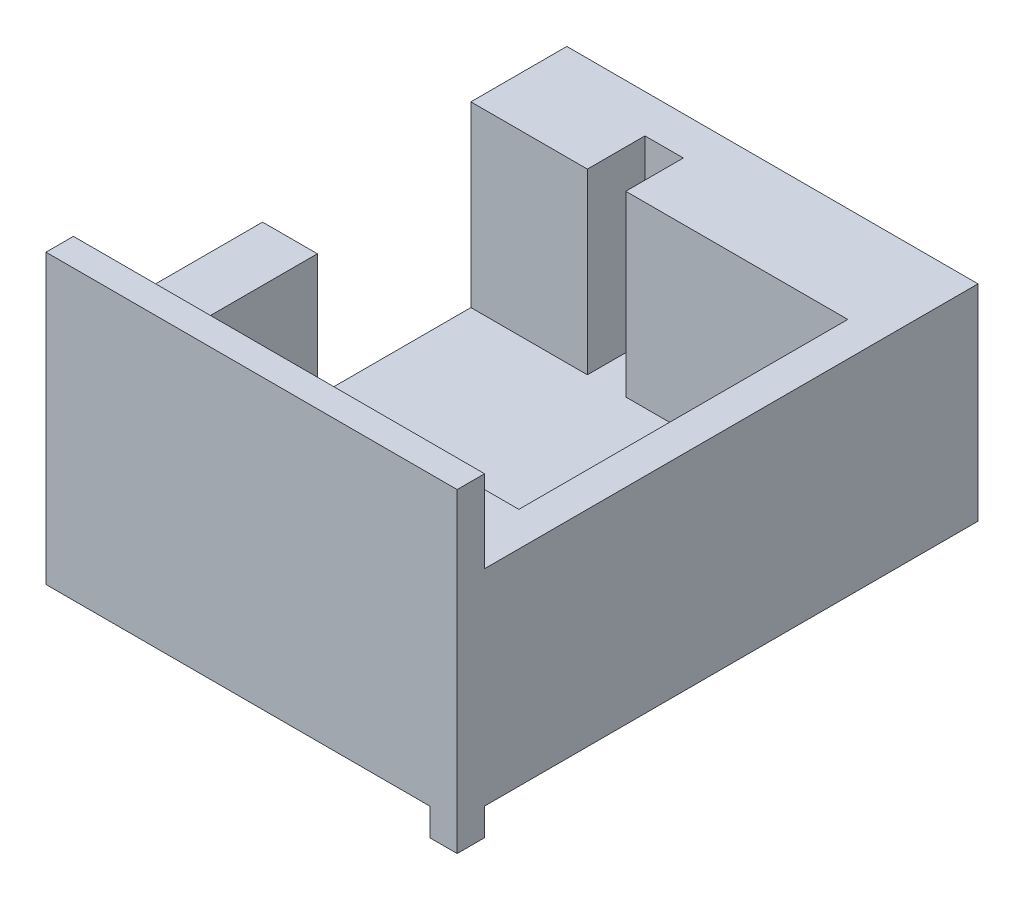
ISO-10303-21;
HEADER;
FILE_DESCRIPTION(('STEP AP214'),'2;1');
FILE_NAME('part.step','',(''),(''),'','','');
FILE_SCHEMA(('AUTOMOTIVE_DESIGN { 1 0 10303 214 1 1 1 1 }'));
ENDSEC;
DATA;
#1=APPLICATION_CONTEXT('core data for automotive mechanical design processes');
#2=APPLICATION_PROTOCOL_DEFINITION('international standard','automotive_design',2000,#1);
#3=PRODUCT_CONTEXT('',#1,'mechanical');
#4=PRODUCT('Part','Part','',(#3));
#5=PRODUCT_RELATED_PRODUCT_CATEGORY('part','',(#4));
#6=PRODUCT_DEFINITION_FORMATION('','',#4);
#7=PRODUCT_DEFINITION_CONTEXT('part definition',#1,'design');
#8=PRODUCT_DEFINITION('design','',#6,#7);
#9=PRODUCT_DEFINITION_SHAPE('','',#8);
#10=(LENGTH_UNIT() NAMED_UNIT(*) SI_UNIT(.MILLI.,.METRE.));
#11=(NAMED_UNIT(*) PLANE_ANGLE_UNIT() SI_UNIT($,.RADIAN.));
#12=(NAMED_UNIT(*) SI_UNIT($,.STERADIAN.) SOLID_ANGLE_UNIT());
#13=UNCERTAINTY_MEASURE_WITH_UNIT(LENGTH_MEASURE(1.E-05),#10,'distance_accuracy_value','');
#14=(GEOMETRIC_REPRESENTATION_CONTEXT(3) GLOBAL_UNCERTAINTY_ASSIGNED_CONTEXT((#13)) GLOBAL_UNIT_ASSIGNED_CONTEXT((#10,
#11,#12)) REPRESENTATION_CONTEXT('',''));
#15=CARTESIAN_POINT('',(0.,0.,0.));
#16=DIRECTION('',(0.,0.,1.));
#17=DIRECTION('',(1.,0.,0.));
#18=AXIS2_PLACEMENT_3D('',#15,#16,#17);
#19=CARTESIAN_POINT('',(-15.,15.,19.));
#20=DIRECTION('',(1.,0.,0.));
#21=DIRECTION('',(0.,0.,-1.));
#22=AXIS2_PLACEMENT_3D('',#19,#20,#21);
#23=PLANE('',#22);
#24=DIRECTION('',(0.,0.,1.));
#25=VECTOR('',#24,1.);
#26=CARTESIAN_POINT('',(-15.,15.,19.));
#27=LINE('',#26,#25);
#28=CARTESIAN_POINT('',(-15.,15.,3.2));
#29=VERTEX_POINT('',#28);
#30=CARTESIAN_POINT('',(-15.,15.,17.));
#31=VERTEX_POINT('',#30);
#32=EDGE_CURVE('E242',#29,#31,#27,.T.);
#33=ORIENTED_EDGE('',*,*,#32,.F.);
#34=DIRECTION('',(0.,1.,0.));
#35=VECTOR('',#34,1.);
#36=CARTESIAN_POINT('',(-15.,15.,3.2));
#37=LINE('',#36,#35);
#38=CARTESIAN_POINT('',(-15.,2.,3.2));
#39=VERTEX_POINT('',#38);
#40=EDGE_CURVE('E225',#39,#29,#37,.T.);
#41=ORIENTED_EDGE('',*,*,#40,.F.);
#42=DIRECTION('',(0.,0.,1.));
#43=VECTOR('',#42,1.);
#44=CARTESIAN_POINT('',(-15.,2.,-12.));
#45=LINE('',#44,#43);
#46=CARTESIAN_POINT('',(-15.,2.,-12.));
#47=VERTEX_POINT('',#46);
#48=EDGE_CURVE('E236',#47,#39,#45,.T.);
#49=ORIENTED_EDGE('',*,*,#48,.F.);
#50=DIRECTION('',(0.,1.,0.));
#51=VECTOR('',#50,1.);
#52=CARTESIAN_POINT('',(-15.,0.,-12.));
#53=LINE('',#52,#51);
#54=CARTESIAN_POINT('',(-15.,15.,-12.));
#55=VERTEX_POINT('',#54);
#56=EDGE_CURVE('E319',#47,#55,#53,.T.);
#57=ORIENTED_EDGE('',*,*,#56,.T.);
#58=CARTESIAN_POINT('',(-15.,15.,-19.));
#59=VERTEX_POINT('',#58);
#60=EDGE_CURVE('E251',#59,#55,#27,.T.);
#61=ORIENTED_EDGE('',*,*,#60,.F.);
#62=DIRECTION('',(0.,-1.,0.));
#63=VECTOR('',#62,1.);
#64=CARTESIAN_POINT('',(-15.,15.,-19.));
#65=LINE('',#64,#63);
#66=CARTESIAN_POINT('',(-15.,0.,-19.));
#67=VERTEX_POINT('',#66);
#68=EDGE_CURVE('E289',#59,#67,#65,.T.);
#69=ORIENTED_EDGE('',*,*,#68,.T.);
#70=DIRECTION('',(0.,0.,1.));
#71=VECTOR('',#70,1.);
#72=CARTESIAN_POINT('',(-15.,0.,19.));
#73=LINE('',#72,#71);
#74=CARTESIAN_POINT('',(-15.,0.,19.));
#75=VERTEX_POINT('',#74);
#76=EDGE_CURVE('E281',#67,#75,#73,.T.);
#77=ORIENTED_EDGE('',*,*,#76,.T.);
#78=DIRECTION('',(0.,-1.,0.));
#79=VECTOR('',#78,1.);
#80=CARTESIAN_POINT('',(-15.,15.,19.));
#81=LINE('',#80,#79);
#82=CARTESIAN_POINT('',(-15.,21.,19.));
#83=VERTEX_POINT('',#82);
#84=EDGE_CURVE('E287',#83,#75,#81,.T.);
#85=ORIENTED_EDGE('',*,*,#84,.F.);
#86=DIRECTION('',(0.,0.,-1.));
#87=VECTOR('',#86,1.);
#88=CARTESIAN_POINT('',(-15.,21.,19.));
#89=LINE('',#88,#87);
#90=CARTESIAN_POINT('',(-15.,21.,17.));
#91=VERTEX_POINT('',#90);
#92=EDGE_CURVE('E470',#83,#91,#89,.T.);
#93=ORIENTED_EDGE('',*,*,#92,.T.);
#94=DIRECTION('',(0.,-1.,0.));
#95=VECTOR('',#94,1.);
#96=CARTESIAN_POINT('',(-15.,15.,17.));
#97=LINE('',#96,#95);
#98=EDGE_CURVE('E249',#91,#31,#97,.T.);
#99=ORIENTED_EDGE('',*,*,#98,.T.);
#100=EDGE_LOOP('',(#33,#41,#49,#57,#61,#69,#77,#85,#93,#99));
#101=FACE_BOUND('',#100,.T.);
#102=ADVANCED_FACE('F57',(#101),#23,.F.);
#103=CARTESIAN_POINT('',(0.,15.,0.));
#104=DIRECTION('',(0.,-1.,0.));
#105=DIRECTION('',(0.,0.,-1.));
#106=AXIS2_PLACEMENT_3D('',#103,#104,#105);
#107=PLANE('',#106);
#108=DIRECTION('',(0.,0.,1.));
#109=VECTOR('',#108,1.);
#110=CARTESIAN_POINT('',(-11.,15.,12.));
#111=LINE('',#110,#109);
#112=CARTESIAN_POINT('',(-11.,15.,3.2));
#113=VERTEX_POINT('',#112);
#114=CARTESIAN_POINT('',(-11.,15.,12.));
#115=VERTEX_POINT('',#114);
#116=EDGE_CURVE('E245',#113,#115,#111,.T.);
#117=ORIENTED_EDGE('',*,*,#116,.F.);
#118=DIRECTION('',(-1.,0.,0.));
#119=VECTOR('',#118,1.);
#120=CARTESIAN_POINT('',(15.00105,15.,3.2));
#121=LINE('',#120,#119);
#122=EDGE_CURVE('E228',#113,#29,#121,.T.);
#123=ORIENTED_EDGE('',*,*,#122,.T.);
#124=ORIENTED_EDGE('',*,*,#32,.T.);
#125=DIRECTION('',(1.,0.,0.));
#126=VECTOR('',#125,1.);
#127=CARTESIAN_POINT('',(-21.3245553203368,15.,17.));
#128=LINE('',#127,#126);
#129=CARTESIAN_POINT('',(15.,15.,17.));
#130=VERTEX_POINT('',#129);
#131=EDGE_CURVE('E412',#31,#130,#128,.T.);
#132=ORIENTED_EDGE('',*,*,#131,.T.);
#133=DIRECTION('',(0.,0.,-1.));
#134=VECTOR('',#133,1.);
#135=CARTESIAN_POINT('',(15.,15.,19.));
#136=LINE('',#135,#134);
#137=CARTESIAN_POINT('',(15.,15.,-19.));
#138=VERTEX_POINT('',#137);
#139=EDGE_CURVE('E257',#130,#138,#136,.T.);
#140=ORIENTED_EDGE('',*,*,#139,.T.);
#141=DIRECTION('',(-1.,0.,0.));
#142=VECTOR('',#141,1.);
#143=CARTESIAN_POINT('',(-15.,15.,-19.));
#144=LINE('',#143,#142);
#145=EDGE_CURVE('E252',#138,#59,#144,.T.);
#146=ORIENTED_EDGE('',*,*,#145,.T.);
#147=ORIENTED_EDGE('',*,*,#60,.T.);
#148=DIRECTION('',(-1.,0.,0.));
#149=VECTOR('',#148,1.);
#150=CARTESIAN_POINT('',(-6.5,15.,-12.));
#151=LINE('',#150,#149);
#152=CARTESIAN_POINT('',(-6.5,15.,-12.));
#153=VERTEX_POINT('',#152);
#154=EDGE_CURVE('E364',#153,#55,#151,.T.);
#155=ORIENTED_EDGE('',*,*,#154,.F.);
#156=DIRECTION('',(0.,0.,1.));
#157=VECTOR('',#156,1.);
#158=CARTESIAN_POINT('',(-6.5,15.,-16.2));
#159=LINE('',#158,#157);
#160=CARTESIAN_POINT('',(-6.5,15.,-16.2));
#161=VERTEX_POINT('',#160);
#162=EDGE_CURVE('E361',#161,#153,#159,.T.);
#163=ORIENTED_EDGE('',*,*,#162,.F.);
#164=DIRECTION('',(-1.,0.,0.));
#165=VECTOR('',#164,1.);
#166=CARTESIAN_POINT('',(-3.7,15.,-16.2));
#167=LINE('',#166,#165);
#168=CARTESIAN_POINT('',(-3.7,15.,-16.2));
#169=VERTEX_POINT('',#168);
#170=EDGE_CURVE('E358',#169,#161,#167,.T.);
#171=ORIENTED_EDGE('',*,*,#170,.F.);
#172=DIRECTION('',(0.,0.,-1.));
#173=VECTOR('',#172,1.);
#174=CARTESIAN_POINT('',(-3.7,15.,-12.));
#175=LINE('',#174,#173);
#176=CARTESIAN_POINT('',(-3.7,15.,-12.));
#177=VERTEX_POINT('',#176);
#178=EDGE_CURVE('E355',#177,#169,#175,.T.);
#179=ORIENTED_EDGE('',*,*,#178,.F.);
#180=DIRECTION('',(-1.,0.,0.));
#181=VECTOR('',#180,1.);
#182=CARTESIAN_POINT('',(12.5,15.,-12.));
#183=LINE('',#182,#181);
#184=CARTESIAN_POINT('',(12.5,15.,-12.));
#185=VERTEX_POINT('',#184);
#186=EDGE_CURVE('E352',#185,#177,#183,.T.);
#187=ORIENTED_EDGE('',*,*,#186,.F.);
#188=DIRECTION('',(0.,0.,-1.));
#189=VECTOR('',#188,1.);
#190=CARTESIAN_POINT('',(12.5,15.,-12.));
#191=LINE('',#190,#189);
#192=CARTESIAN_POINT('',(12.5,15.,12.));
#193=VERTEX_POINT('',#192);
#194=EDGE_CURVE('E349',#193,#185,#191,.T.);
#195=ORIENTED_EDGE('',*,*,#194,.F.);
#196=DIRECTION('',(1.,0.,0.));
#197=VECTOR('',#196,1.);
#198=CARTESIAN_POINT('',(12.5,15.,12.));
#199=LINE('',#198,#197);
#200=CARTESIAN_POINT('',(-3.7,15.,12.));
#201=VERTEX_POINT('',#200);
#202=EDGE_CURVE('E347',#201,#193,#199,.T.);
#203=ORIENTED_EDGE('',*,*,#202,.F.);
#204=DIRECTION('',(0.,0.,-1.));
#205=VECTOR('',#204,1.);
#206=CARTESIAN_POINT('',(-3.7,15.,12.));
#207=LINE('',#206,#205);
#208=CARTESIAN_POINT('',(-3.7,15.,16.2));
#209=VERTEX_POINT('',#208);
#210=EDGE_CURVE('E314',#209,#201,#207,.T.);
#211=ORIENTED_EDGE('',*,*,#210,.F.);
#212=DIRECTION('',(1.,0.,0.));
#213=VECTOR('',#212,1.);
#214=CARTESIAN_POINT('',(-3.7,15.,16.2));
#215=LINE('',#214,#213);
#216=CARTESIAN_POINT('',(-6.5,15.,16.2));
#217=VERTEX_POINT('',#216);
#218=EDGE_CURVE('E373',#217,#209,#215,.T.);
#219=ORIENTED_EDGE('',*,*,#218,.F.);
#220=DIRECTION('',(0.,0.,1.));
#221=VECTOR('',#220,1.);
#222=CARTESIAN_POINT('',(-6.5,15.,16.2));
#223=LINE('',#222,#221);
#224=CARTESIAN_POINT('',(-6.5,15.,12.));
#225=VERTEX_POINT('',#224);
#226=EDGE_CURVE('E370',#225,#217,#223,.T.);
#227=ORIENTED_EDGE('',*,*,#226,.F.);
#228=DIRECTION('',(1.,0.,0.));
#229=VECTOR('',#228,1.);
#230=CARTESIAN_POINT('',(-6.5,15.,12.));
#231=LINE('',#230,#229);
#232=EDGE_CURVE('E367',#115,#225,#231,.T.);
#233=ORIENTED_EDGE('',*,*,#232,.F.);
#234=EDGE_LOOP('',(#117,#123,#124,#132,#140,#146,#147,#155,#163,#171,#179,#187,#195,#203,#211,
#219,#227,#233));
#235=FACE_BOUND('',#234,.T.);
#236=ADVANCED_FACE('F240',(#235),#107,.F.);
#237=CARTESIAN_POINT('',(-11.,2.,12.));
#238=DIRECTION('',(-1.,0.,0.));
#239=DIRECTION('',(0.,0.,1.));
#240=AXIS2_PLACEMENT_3D('',#237,#238,#239);
#241=PLANE('',#240);
#242=DIRECTION('',(0.,0.,1.));
#243=VECTOR('',#242,1.);
#244=CARTESIAN_POINT('',(-11.,2.,12.));
#245=LINE('',#244,#243);
#246=CARTESIAN_POINT('',(-11.,2.,3.2));
#247=VERTEX_POINT('',#246);
#248=CARTESIAN_POINT('',(-11.,2.,12.));
#249=VERTEX_POINT('',#248);
#250=EDGE_CURVE('E332',#247,#249,#245,.T.);
#251=ORIENTED_EDGE('',*,*,#250,.F.);
#252=DIRECTION('',(0.,-1.,0.));
#253=VECTOR('',#252,1.);
#254=CARTESIAN_POINT('',(-11.,15.,3.2));
#255=LINE('',#254,#253);
#256=EDGE_CURVE('E246',#113,#247,#255,.T.);
#257=ORIENTED_EDGE('',*,*,#256,.F.);
#258=ORIENTED_EDGE('',*,*,#116,.T.);
#259=DIRECTION('',(0.,1.,0.));
#260=VECTOR('',#259,1.);
#261=CARTESIAN_POINT('',(-11.,2.,12.));
#262=LINE('',#261,#260);
#263=EDGE_CURVE('E385',#249,#115,#262,.T.);
#264=ORIENTED_EDGE('',*,*,#263,.F.);
#265=EDGE_LOOP('',(#251,#257,#258,#264));
#266=FACE_BOUND('',#265,.T.);
#267=ADVANCED_FACE('F501',(#266),#241,.F.);
#268=CARTESIAN_POINT('',(15.,15.,19.));
#269=DIRECTION('',(-1.,0.,0.));
#270=DIRECTION('',(0.,0.,1.));
#271=AXIS2_PLACEMENT_3D('',#268,#269,#270);
#272=PLANE('',#271);
#273=DIRECTION('',(0.,-1.,0.));
#274=VECTOR('',#273,1.);
#275=CARTESIAN_POINT('',(15.,15.,19.));
#276=LINE('',#275,#274);
#277=CARTESIAN_POINT('',(15.,21.,19.));
#278=VERTEX_POINT('',#277);
#279=CARTESIAN_POINT('',(15.,-2.,19.));
#280=VERTEX_POINT('',#279);
#281=EDGE_CURVE('E255',#278,#280,#276,.T.);
#282=ORIENTED_EDGE('',*,*,#281,.T.);
#283=DIRECTION('',(0.,0.,1.));
#284=VECTOR('',#283,1.);
#285=CARTESIAN_POINT('',(15.,-2.,19.));
#286=LINE('',#285,#284);
#287=CARTESIAN_POINT('',(15.,-2.,17.));
#288=VERTEX_POINT('',#287);
#289=EDGE_CURVE('E419',#288,#280,#286,.T.);
#290=ORIENTED_EDGE('',*,*,#289,.F.);
#291=DIRECTION('',(0.,1.,0.));
#292=VECTOR('',#291,1.);
#293=CARTESIAN_POINT('',(15.,-2.,17.));
#294=LINE('',#293,#292);
#295=CARTESIAN_POINT('',(15.,0.,17.));
#296=VERTEX_POINT('',#295);
#297=EDGE_CURVE('E429',#288,#296,#294,.T.);
#298=ORIENTED_EDGE('',*,*,#297,.T.);
#299=DIRECTION('',(0.,0.,-1.));
#300=VECTOR('',#299,1.);
#301=CARTESIAN_POINT('',(15.,0.,19.));
#302=LINE('',#301,#300);
#303=CARTESIAN_POINT('',(15.,0.,-19.));
#304=VERTEX_POINT('',#303);
#305=EDGE_CURVE('E271',#296,#304,#302,.T.);
#306=ORIENTED_EDGE('',*,*,#305,.T.);
#307=DIRECTION('',(0.,-1.,0.));
#308=VECTOR('',#307,1.);
#309=CARTESIAN_POINT('',(15.,15.,-19.));
#310=LINE('',#309,#308);
#311=EDGE_CURVE('E275',#138,#304,#310,.T.);
#312=ORIENTED_EDGE('',*,*,#311,.F.);
#313=ORIENTED_EDGE('',*,*,#139,.F.);
#314=DIRECTION('',(0.,1.,0.));
#315=VECTOR('',#314,1.);
#316=CARTESIAN_POINT('',(15.,15.,17.));
#317=LINE('',#316,#315);
#318=CARTESIAN_POINT('',(15.,21.,17.));
#319=VERTEX_POINT('',#318);
#320=EDGE_CURVE('E405',#130,#319,#317,.T.);
#321=ORIENTED_EDGE('',*,*,#320,.T.);
#322=DIRECTION('',(0.,0.,1.));
#323=VECTOR('',#322,1.);
#324=CARTESIAN_POINT('',(15.,21.,19.));
#325=LINE('',#324,#323);
#326=EDGE_CURVE('E408',#319,#278,#325,.T.);
#327=ORIENTED_EDGE('',*,*,#326,.T.);
#328=EDGE_LOOP('',(#282,#290,#298,#306,#312,#313,#321,#327));
#329=FACE_BOUND('',#328,.T.);
#330=ADVANCED_FACE('F59',(#329),#272,.F.);
#331=CARTESIAN_POINT('',(-15.,15.,-19.));
#332=DIRECTION('',(0.,0.,1.));
#333=DIRECTION('',(1.,0.,0.));
#334=AXIS2_PLACEMENT_3D('',#331,#332,#333);
#335=PLANE('',#334);
#336=DIRECTION('',(-1.,0.,0.));
#337=VECTOR('',#336,1.);
#338=CARTESIAN_POINT('',(-15.,0.,-19.));
#339=LINE('',#338,#337);
#340=EDGE_CURVE('E268',#304,#67,#339,.T.);
#341=ORIENTED_EDGE('',*,*,#340,.T.);
#342=ORIENTED_EDGE('',*,*,#68,.F.);
#343=ORIENTED_EDGE('',*,*,#145,.F.);
#344=ORIENTED_EDGE('',*,*,#311,.T.);
#345=EDGE_LOOP('',(#341,#342,#343,#344));
#346=FACE_BOUND('',#345,.T.);
#347=ADVANCED_FACE('F459',(#346),#335,.F.);
#348=CARTESIAN_POINT('',(-15.,15.,19.));
#349=DIRECTION('',(0.,0.,-1.));
#350=DIRECTION('',(-1.,0.,0.));
#351=AXIS2_PLACEMENT_3D('',#348,#349,#350);
#352=PLANE('',#351);
#353=DIRECTION('',(1.,0.,0.));
#354=VECTOR('',#353,1.);
#355=CARTESIAN_POINT('',(-15.,0.,19.));
#356=LINE('',#355,#354);
#357=CARTESIAN_POINT('',(13.,0.,19.));
#358=VERTEX_POINT('',#357);
#359=EDGE_CURVE('E277',#75,#358,#356,.T.);
#360=ORIENTED_EDGE('',*,*,#359,.T.);
#361=DIRECTION('',(0.,1.,0.));
#362=VECTOR('',#361,1.);
#363=CARTESIAN_POINT('',(13.,-2.,19.));
#364=LINE('',#363,#362);
#365=CARTESIAN_POINT('',(13.,-2.,19.));
#366=VERTEX_POINT('',#365);
#367=EDGE_CURVE('E442',#366,#358,#364,.T.);
#368=ORIENTED_EDGE('',*,*,#367,.F.);
#369=DIRECTION('',(-1.,0.,0.));
#370=VECTOR('',#369,1.);
#371=CARTESIAN_POINT('',(15.,-2.,19.));
#372=LINE('',#371,#370);
#373=EDGE_CURVE('E422',#280,#366,#372,.T.);
#374=ORIENTED_EDGE('',*,*,#373,.F.);
#375=ORIENTED_EDGE('',*,*,#281,.F.);
#376=DIRECTION('',(1.,0.,0.));
#377=VECTOR('',#376,1.);
#378=CARTESIAN_POINT('',(-21.3245553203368,21.,19.));
#379=LINE('',#378,#377);
#380=EDGE_CURVE('E468',#83,#278,#379,.T.);
#381=ORIENTED_EDGE('',*,*,#380,.F.);
#382=ORIENTED_EDGE('',*,*,#84,.T.);
#383=EDGE_LOOP('',(#360,#368,#374,#375,#381,#382));
#384=FACE_BOUND('',#383,.T.);
#385=ADVANCED_FACE('F466',(#384),#352,.F.);
#386=CARTESIAN_POINT('',(0.,0.,0.));
#387=DIRECTION('',(0.,-1.,0.));
#388=DIRECTION('',(0.,0.,-1.));
#389=AXIS2_PLACEMENT_3D('',#386,#387,#388);
#390=PLANE('',#389);
#391=DIRECTION('',(0.,0.,1.));
#392=VECTOR('',#391,1.);
#393=CARTESIAN_POINT('',(12.5,0.,0.));
#394=LINE('',#393,#392);
#395=CARTESIAN_POINT('',(12.5,0.,-12.));
#396=VERTEX_POINT('',#395);
#397=CARTESIAN_POINT('',(12.5,0.,12.));
#398=VERTEX_POINT('',#397);
#399=EDGE_CURVE('E12',#396,#398,#394,.T.);
#400=ORIENTED_EDGE('',*,*,#399,.F.);
#401=DIRECTION('',(1.,0.,0.));
#402=VECTOR('',#401,1.);
#403=CARTESIAN_POINT('',(0.,0.,-12.));
#404=LINE('',#403,#402);
#405=CARTESIAN_POINT('',(9.49999999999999,0.,-12.));
#406=VERTEX_POINT('',#405);
#407=EDGE_CURVE('E295',#406,#396,#404,.T.);
#408=ORIENTED_EDGE('',*,*,#407,.F.);
#409=DIRECTION('',(0.,0.,-1.));
#410=VECTOR('',#409,1.);
#411=CARTESIAN_POINT('',(9.5,0.,0.));
#412=LINE('',#411,#410);
#413=CARTESIAN_POINT('',(9.5,0.,12.));
#414=VERTEX_POINT('',#413);
#415=EDGE_CURVE('E299',#414,#406,#412,.T.);
#416=ORIENTED_EDGE('',*,*,#415,.F.);
#417=DIRECTION('',(-1.,0.,0.));
#418=VECTOR('',#417,1.);
#419=CARTESIAN_POINT('',(0.,0.,12.));
#420=LINE('',#419,#418);
#421=EDGE_CURVE('E66',#398,#414,#420,.T.);
#422=ORIENTED_EDGE('',*,*,#421,.F.);
#423=EDGE_LOOP('',(#400,#408,#416,#422));
#424=FACE_BOUND('',#423,.T.);
#425=DIRECTION('',(1.,0.,0.));
#426=VECTOR('',#425,1.);
#427=CARTESIAN_POINT('',(15.,0.,17.));
#428=LINE('',#427,#426);
#429=CARTESIAN_POINT('',(13.,0.,17.));
#430=VERTEX_POINT('',#429);
#431=EDGE_CURVE('E423',#430,#296,#428,.T.);
#432=ORIENTED_EDGE('',*,*,#431,.F.);
#433=DIRECTION('',(0.,0.,-1.));
#434=VECTOR('',#433,1.);
#435=CARTESIAN_POINT('',(13.,0.,19.));
#436=LINE('',#435,#434);
#437=EDGE_CURVE('E282',#358,#430,#436,.T.);
#438=ORIENTED_EDGE('',*,*,#437,.F.);
#439=ORIENTED_EDGE('',*,*,#359,.F.);
#440=ORIENTED_EDGE('',*,*,#76,.F.);
#441=ORIENTED_EDGE('',*,*,#340,.F.);
#442=ORIENTED_EDGE('',*,*,#305,.F.);
#443=EDGE_LOOP('',(#432,#438,#439,#440,#441,#442));
#444=FACE_BOUND('',#443,.T.);
#445=ADVANCED_FACE('F469',(#424,#444),#390,.T.);
#446=CARTESIAN_POINT('',(12.5,2.,12.));
#447=DIRECTION('',(0.,0.,1.));
#448=DIRECTION('',(1.,0.,0.));
#449=AXIS2_PLACEMENT_3D('',#446,#447,#448);
#450=PLANE('',#449);
#451=ORIENTED_EDGE('',*,*,#202,.T.);
#452=DIRECTION('',(0.,1.,0.));
#453=VECTOR('',#452,1.);
#454=CARTESIAN_POINT('',(12.5,2.,12.));
#455=LINE('',#454,#453);
#456=EDGE_CURVE('E346',#398,#193,#455,.T.);
#457=ORIENTED_EDGE('',*,*,#456,.F.);
#458=ORIENTED_EDGE('',*,*,#421,.T.);
#459=DIRECTION('',(0.,1.,0.));
#460=VECTOR('',#459,1.);
#461=CARTESIAN_POINT('',(9.5,-8.,12.));
#462=LINE('',#461,#460);
#463=CARTESIAN_POINT('',(9.5,2.,12.));
#464=VERTEX_POINT('',#463);
#465=EDGE_CURVE('E409',#414,#464,#462,.T.);
#466=ORIENTED_EDGE('',*,*,#465,.T.);
#467=DIRECTION('',(1.,0.,0.));
#468=VECTOR('',#467,1.);
#469=CARTESIAN_POINT('',(12.5,2.,12.));
#470=LINE('',#469,#468);
#471=CARTESIAN_POINT('',(-3.7,2.,12.));
#472=VERTEX_POINT('',#471);
#473=EDGE_CURVE('E309',#472,#464,#470,.T.);
#474=ORIENTED_EDGE('',*,*,#473,.F.);
#475=DIRECTION('',(0.,1.,0.));
#476=VECTOR('',#475,1.);
#477=CARTESIAN_POINT('',(-3.7,2.,12.));
#478=LINE('',#477,#476);
#479=EDGE_CURVE('E274',#472,#201,#478,.T.);
#480=ORIENTED_EDGE('',*,*,#479,.T.);
#481=EDGE_LOOP('',(#451,#457,#458,#466,#474,#480));
#482=FACE_BOUND('',#481,.T.);
#483=ADVANCED_FACE('F545',(#482),#450,.F.);
#484=CARTESIAN_POINT('',(-3.7,2.,12.));
#485=DIRECTION('',(1.,0.,0.));
#486=DIRECTION('',(0.,0.,-1.));
#487=AXIS2_PLACEMENT_3D('',#484,#485,#486);
#488=PLANE('',#487);
#489=ORIENTED_EDGE('',*,*,#210,.T.);
#490=ORIENTED_EDGE('',*,*,#479,.F.);
#491=DIRECTION('',(0.,0.,-1.));
#492=VECTOR('',#491,1.);
#493=CARTESIAN_POINT('',(-3.7,2.,12.));
#494=LINE('',#493,#492);
#495=CARTESIAN_POINT('',(-3.7,2.,16.2));
#496=VERTEX_POINT('',#495);
#497=EDGE_CURVE('E343',#496,#472,#494,.T.);
#498=ORIENTED_EDGE('',*,*,#497,.F.);
#499=DIRECTION('',(0.,1.,0.));
#500=VECTOR('',#499,1.);
#501=CARTESIAN_POINT('',(-3.7,2.,16.2));
#502=LINE('',#501,#500);
#503=EDGE_CURVE('E379',#496,#209,#502,.T.);
#504=ORIENTED_EDGE('',*,*,#503,.T.);
#505=EDGE_LOOP('',(#489,#490,#498,#504));
#506=FACE_BOUND('',#505,.T.);
#507=ADVANCED_FACE('F547',(#506),#488,.F.);
#508=CARTESIAN_POINT('',(-3.7,2.,16.2));
#509=DIRECTION('',(0.,0.,1.));
#510=DIRECTION('',(1.,0.,0.));
#511=AXIS2_PLACEMENT_3D('',#508,#509,#510);
#512=PLANE('',#511);
#513=ORIENTED_EDGE('',*,*,#218,.T.);
#514=ORIENTED_EDGE('',*,*,#503,.F.);
#515=DIRECTION('',(1.,0.,0.));
#516=VECTOR('',#515,1.);
#517=CARTESIAN_POINT('',(-3.7,2.,16.2));
#518=LINE('',#517,#516);
#519=CARTESIAN_POINT('',(-6.5,2.,16.2));
#520=VERTEX_POINT('',#519);
#521=EDGE_CURVE('E340',#520,#496,#518,.T.);
#522=ORIENTED_EDGE('',*,*,#521,.F.);
#523=DIRECTION('',(0.,1.,0.));
#524=VECTOR('',#523,1.);
#525=CARTESIAN_POINT('',(-6.5,2.,16.2));
#526=LINE('',#525,#524);
#527=EDGE_CURVE('E381',#520,#217,#526,.T.);
#528=ORIENTED_EDGE('',*,*,#527,.T.);
#529=EDGE_LOOP('',(#513,#514,#522,#528));
#530=FACE_BOUND('',#529,.T.);
#531=ADVANCED_FACE('F721',(#530),#512,.F.);
#532=CARTESIAN_POINT('',(-6.5,2.,16.2));
#533=DIRECTION('',(-1.,0.,0.));
#534=DIRECTION('',(0.,0.,1.));
#535=AXIS2_PLACEMENT_3D('',#532,#533,#534);
#536=PLANE('',#535);
#537=ORIENTED_EDGE('',*,*,#226,.T.);
#538=ORIENTED_EDGE('',*,*,#527,.F.);
#539=DIRECTION('',(0.,0.,1.));
#540=VECTOR('',#539,1.);
#541=CARTESIAN_POINT('',(-6.5,2.,16.2));
#542=LINE('',#541,#540);
#543=CARTESIAN_POINT('',(-6.5,2.,12.));
#544=VERTEX_POINT('',#543);
#545=EDGE_CURVE('E337',#544,#520,#542,.T.);
#546=ORIENTED_EDGE('',*,*,#545,.F.);
#547=DIRECTION('',(0.,1.,0.));
#548=VECTOR('',#547,1.);
#549=CARTESIAN_POINT('',(-6.5,2.,12.));
#550=LINE('',#549,#548);
#551=EDGE_CURVE('E383',#544,#225,#550,.T.);
#552=ORIENTED_EDGE('',*,*,#551,.T.);
#553=EDGE_LOOP('',(#537,#538,#546,#552));
#554=FACE_BOUND('',#553,.T.);
#555=ADVANCED_FACE('F712',(#554),#536,.F.);
#556=CARTESIAN_POINT('',(-6.5,2.,12.));
#557=DIRECTION('',(0.,0.,1.));
#558=DIRECTION('',(1.,0.,0.));
#559=AXIS2_PLACEMENT_3D('',#556,#557,#558);
#560=PLANE('',#559);
#561=ORIENTED_EDGE('',*,*,#232,.T.);
#562=ORIENTED_EDGE('',*,*,#551,.F.);
#563=DIRECTION('',(1.,0.,0.));
#564=VECTOR('',#563,1.);
#565=CARTESIAN_POINT('',(-6.5,2.,12.));
#566=LINE('',#565,#564);
#567=EDGE_CURVE('E334',#249,#544,#566,.T.);
#568=ORIENTED_EDGE('',*,*,#567,.F.);
#569=ORIENTED_EDGE('',*,*,#263,.T.);
#570=EDGE_LOOP('',(#561,#562,#568,#569));
#571=FACE_BOUND('',#570,.T.);
#572=ADVANCED_FACE('F520',(#571),#560,.F.);
#573=CARTESIAN_POINT('',(-6.5,2.,-12.));
#574=DIRECTION('',(0.,0.,-1.));
#575=DIRECTION('',(-1.,0.,0.));
#576=AXIS2_PLACEMENT_3D('',#573,#574,#575);
#577=PLANE('',#576);
#578=ORIENTED_EDGE('',*,*,#154,.T.);
#579=ORIENTED_EDGE('',*,*,#56,.F.);
#580=DIRECTION('',(-1.,0.,0.));
#581=VECTOR('',#580,1.);
#582=CARTESIAN_POINT('',(-6.5,2.,-12.));
#583=LINE('',#582,#581);
#584=CARTESIAN_POINT('',(-6.5,2.,-12.));
#585=VERTEX_POINT('',#584);
#586=EDGE_CURVE('E262',#585,#47,#583,.T.);
#587=ORIENTED_EDGE('',*,*,#586,.F.);
#588=DIRECTION('',(0.,1.,0.));
#589=VECTOR('',#588,1.);
#590=CARTESIAN_POINT('',(-6.5,2.,-12.));
#591=LINE('',#590,#589);
#592=EDGE_CURVE('E388',#585,#153,#591,.T.);
#593=ORIENTED_EDGE('',*,*,#592,.T.);
#594=EDGE_LOOP('',(#578,#579,#587,#593));
#595=FACE_BOUND('',#594,.T.);
#596=ADVANCED_FACE('F522',(#595),#577,.F.);
#597=CARTESIAN_POINT('',(-6.5,2.,-16.2));
#598=DIRECTION('',(-1.,0.,0.));
#599=DIRECTION('',(0.,0.,1.));
#600=AXIS2_PLACEMENT_3D('',#597,#598,#599);
#601=PLANE('',#600);
#602=ORIENTED_EDGE('',*,*,#162,.T.);
#603=ORIENTED_EDGE('',*,*,#592,.F.);
#604=DIRECTION('',(0.,0.,1.));
#605=VECTOR('',#604,1.);
#606=CARTESIAN_POINT('',(-6.5,2.,-16.2));
#607=LINE('',#606,#605);
#608=CARTESIAN_POINT('',(-6.5,2.,-16.2));
#609=VERTEX_POINT('',#608);
#610=EDGE_CURVE('E329',#609,#585,#607,.T.);
#611=ORIENTED_EDGE('',*,*,#610,.F.);
#612=DIRECTION('',(0.,1.,0.));
#613=VECTOR('',#612,1.);
#614=CARTESIAN_POINT('',(-6.5,2.,-16.2));
#615=LINE('',#614,#613);
#616=EDGE_CURVE('E390',#609,#161,#615,.T.);
#617=ORIENTED_EDGE('',*,*,#616,.T.);
#618=EDGE_LOOP('',(#602,#603,#611,#617));
#619=FACE_BOUND('',#618,.T.);
#620=ADVANCED_FACE('F525',(#619),#601,.F.);
#621=CARTESIAN_POINT('',(-3.7,2.,-16.2));
#622=DIRECTION('',(0.,0.,-1.));
#623=DIRECTION('',(-1.,0.,0.));
#624=AXIS2_PLACEMENT_3D('',#621,#622,#623);
#625=PLANE('',#624);
#626=ORIENTED_EDGE('',*,*,#170,.T.);
#627=ORIENTED_EDGE('',*,*,#616,.F.);
#628=DIRECTION('',(-1.,0.,0.));
#629=VECTOR('',#628,1.);
#630=CARTESIAN_POINT('',(-3.7,2.,-16.2));
#631=LINE('',#630,#629);
#632=CARTESIAN_POINT('',(-3.7,2.,-16.2));
#633=VERTEX_POINT('',#632);
#634=EDGE_CURVE('E326',#633,#609,#631,.T.);
#635=ORIENTED_EDGE('',*,*,#634,.F.);
#636=DIRECTION('',(0.,1.,0.));
#637=VECTOR('',#636,1.);
#638=CARTESIAN_POINT('',(-3.7,2.,-16.2));
#639=LINE('',#638,#637);
#640=EDGE_CURVE('E392',#633,#169,#639,.T.);
#641=ORIENTED_EDGE('',*,*,#640,.T.);
#642=EDGE_LOOP('',(#626,#627,#635,#641));
#643=FACE_BOUND('',#642,.T.);
#644=ADVANCED_FACE('F528',(#643),#625,.F.);
#645=CARTESIAN_POINT('',(-3.7,2.,-12.));
#646=DIRECTION('',(1.,0.,0.));
#647=DIRECTION('',(0.,0.,-1.));
#648=AXIS2_PLACEMENT_3D('',#645,#646,#647);
#649=PLANE('',#648);
#650=ORIENTED_EDGE('',*,*,#178,.T.);
#651=ORIENTED_EDGE('',*,*,#640,.F.);
#652=DIRECTION('',(0.,0.,-1.));
#653=VECTOR('',#652,1.);
#654=CARTESIAN_POINT('',(-3.7,2.,-12.));
#655=LINE('',#654,#653);
#656=CARTESIAN_POINT('',(-3.7,2.,-12.));
#657=VERTEX_POINT('',#656);
#658=EDGE_CURVE('E323',#657,#633,#655,.T.);
#659=ORIENTED_EDGE('',*,*,#658,.F.);
#660=DIRECTION('',(0.,1.,0.));
#661=VECTOR('',#660,1.);
#662=CARTESIAN_POINT('',(-3.7,2.,-12.));
#663=LINE('',#662,#661);
#664=EDGE_CURVE('E394',#657,#177,#663,.T.);
#665=ORIENTED_EDGE('',*,*,#664,.T.);
#666=EDGE_LOOP('',(#650,#651,#659,#665));
#667=FACE_BOUND('',#666,.T.);
#668=ADVANCED_FACE('F532',(#667),#649,.F.);
#669=CARTESIAN_POINT('',(12.5,2.,-12.));
#670=DIRECTION('',(0.,0.,-1.));
#671=DIRECTION('',(-1.,0.,0.));
#672=AXIS2_PLACEMENT_3D('',#669,#670,#671);
#673=PLANE('',#672);
#674=ORIENTED_EDGE('',*,*,#186,.T.);
#675=ORIENTED_EDGE('',*,*,#664,.F.);
#676=DIRECTION('',(-1.,0.,0.));
#677=VECTOR('',#676,1.);
#678=CARTESIAN_POINT('',(12.5,2.,-12.));
#679=LINE('',#678,#677);
#680=CARTESIAN_POINT('',(9.5,2.,-12.));
#681=VERTEX_POINT('',#680);
#682=EDGE_CURVE('E313',#681,#657,#679,.T.);
#683=ORIENTED_EDGE('',*,*,#682,.F.);
#684=DIRECTION('',(0.,1.,0.));
#685=VECTOR('',#684,1.);
#686=CARTESIAN_POINT('',(9.49999999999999,-8.,-12.));
#687=LINE('',#686,#685);
#688=EDGE_CURVE('E74',#406,#681,#687,.T.);
#689=ORIENTED_EDGE('',*,*,#688,.F.);
#690=ORIENTED_EDGE('',*,*,#407,.T.);
#691=DIRECTION('',(0.,1.,0.));
#692=VECTOR('',#691,1.);
#693=CARTESIAN_POINT('',(12.5,2.,-12.));
#694=LINE('',#693,#692);
#695=EDGE_CURVE('E396',#396,#185,#694,.T.);
#696=ORIENTED_EDGE('',*,*,#695,.T.);
#697=EDGE_LOOP('',(#674,#675,#683,#689,#690,#696));
#698=FACE_BOUND('',#697,.T.);
#699=ADVANCED_FACE('F536',(#698),#673,.F.);
#700=CARTESIAN_POINT('',(12.5,2.,-12.));
#701=DIRECTION('',(1.,0.,0.));
#702=DIRECTION('',(0.,0.,-1.));
#703=AXIS2_PLACEMENT_3D('',#700,#701,#702);
#704=PLANE('',#703);
#705=ORIENTED_EDGE('',*,*,#194,.T.);
#706=ORIENTED_EDGE('',*,*,#695,.F.);
#707=ORIENTED_EDGE('',*,*,#399,.T.);
#708=ORIENTED_EDGE('',*,*,#456,.T.);
#709=EDGE_LOOP('',(#705,#706,#707,#708));
#710=FACE_BOUND('',#709,.T.);
#711=ADVANCED_FACE('F540',(#710),#704,.F.);
#712=CARTESIAN_POINT('',(0.,2.,0.));
#713=DIRECTION('',(0.,1.,0.));
#714=DIRECTION('',(0.,0.,1.));
#715=AXIS2_PLACEMENT_3D('',#712,#713,#714);
#716=PLANE('',#715);
#717=DIRECTION('',(0.,0.,1.));
#718=VECTOR('',#717,1.);
#719=CARTESIAN_POINT('',(9.49999999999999,2.,-12.));
#720=LINE('',#719,#718);
#721=EDGE_CURVE('E563',#681,#464,#720,.T.);
#722=ORIENTED_EDGE('',*,*,#721,.F.);
#723=ORIENTED_EDGE('',*,*,#682,.T.);
#724=ORIENTED_EDGE('',*,*,#658,.T.);
#725=ORIENTED_EDGE('',*,*,#634,.T.);
#726=ORIENTED_EDGE('',*,*,#610,.T.);
#727=ORIENTED_EDGE('',*,*,#586,.T.);
#728=ORIENTED_EDGE('',*,*,#48,.T.);
#729=DIRECTION('',(-1.,0.,0.));
#730=VECTOR('',#729,1.);
#731=CARTESIAN_POINT('',(15.00105,2.,3.2));
#732=LINE('',#731,#730);
#733=EDGE_CURVE('E231',#247,#39,#732,.T.);
#734=ORIENTED_EDGE('',*,*,#733,.F.);
#735=ORIENTED_EDGE('',*,*,#250,.T.);
#736=ORIENTED_EDGE('',*,*,#567,.T.);
#737=ORIENTED_EDGE('',*,*,#545,.T.);
#738=ORIENTED_EDGE('',*,*,#521,.T.);
#739=ORIENTED_EDGE('',*,*,#497,.T.);
#740=ORIENTED_EDGE('',*,*,#473,.T.);
#741=EDGE_LOOP('',(#722,#723,#724,#725,#726,#727,#728,#734,#735,#736,#737,#738,#739,#740));
#742=FACE_BOUND('',#741,.T.);
#743=ADVANCED_FACE('F543',(#742),#716,.T.);
#744=CARTESIAN_POINT('',(13.,-2.,19.));
#745=DIRECTION('',(1.,0.,0.));
#746=DIRECTION('',(0.,0.,-1.));
#747=AXIS2_PLACEMENT_3D('',#744,#745,#746);
#748=PLANE('',#747);
#749=ORIENTED_EDGE('',*,*,#437,.T.);
#750=DIRECTION('',(0.,1.,0.));
#751=VECTOR('',#750,1.);
#752=CARTESIAN_POINT('',(13.,-2.,17.));
#753=LINE('',#752,#751);
#754=CARTESIAN_POINT('',(13.,-2.,17.));
#755=VERTEX_POINT('',#754);
#756=EDGE_CURVE('E431',#755,#430,#753,.T.);
#757=ORIENTED_EDGE('',*,*,#756,.F.);
#758=DIRECTION('',(0.,0.,-1.));
#759=VECTOR('',#758,1.);
#760=CARTESIAN_POINT('',(13.,-2.,19.));
#761=LINE('',#760,#759);
#762=EDGE_CURVE('E425',#366,#755,#761,.T.);
#763=ORIENTED_EDGE('',*,*,#762,.F.);
#764=ORIENTED_EDGE('',*,*,#367,.T.);
#765=EDGE_LOOP('',(#749,#757,#763,#764));
#766=FACE_BOUND('',#765,.T.);
#767=ADVANCED_FACE('F586',(#766),#748,.F.);
#768=CARTESIAN_POINT('',(15.,-2.,17.));
#769=DIRECTION('',(0.,0.,1.));
#770=DIRECTION('',(1.,0.,0.));
#771=AXIS2_PLACEMENT_3D('',#768,#769,#770);
#772=PLANE('',#771);
#773=ORIENTED_EDGE('',*,*,#431,.T.);
#774=ORIENTED_EDGE('',*,*,#297,.F.);
#775=DIRECTION('',(1.,0.,0.));
#776=VECTOR('',#775,1.);
#777=CARTESIAN_POINT('',(15.,-2.,17.));
#778=LINE('',#777,#776);
#779=EDGE_CURVE('E427',#755,#288,#778,.T.);
#780=ORIENTED_EDGE('',*,*,#779,.F.);
#781=ORIENTED_EDGE('',*,*,#756,.T.);
#782=EDGE_LOOP('',(#773,#774,#780,#781));
#783=FACE_BOUND('',#782,.T.);
#784=ADVANCED_FACE('F492',(#783),#772,.F.);
#785=CARTESIAN_POINT('',(0.,-2.,0.));
#786=DIRECTION('',(0.,1.,0.));
#787=DIRECTION('',(0.,0.,1.));
#788=AXIS2_PLACEMENT_3D('',#785,#786,#787);
#789=PLANE('',#788);
#790=ORIENTED_EDGE('',*,*,#289,.T.);
#791=ORIENTED_EDGE('',*,*,#373,.T.);
#792=ORIENTED_EDGE('',*,*,#762,.T.);
#793=ORIENTED_EDGE('',*,*,#779,.T.);
#794=EDGE_LOOP('',(#790,#791,#792,#793));
#795=FACE_BOUND('',#794,.T.);
#796=ADVANCED_FACE('F484',(#795),#789,.F.);
#797=CARTESIAN_POINT('',(-21.3245553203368,21.,19.));
#798=DIRECTION('',(0.,1.,0.));
#799=DIRECTION('',(0.,0.,1.));
#800=AXIS2_PLACEMENT_3D('',#797,#798,#799);
#801=PLANE('',#800);
#802=ORIENTED_EDGE('',*,*,#92,.F.);
#803=ORIENTED_EDGE('',*,*,#380,.T.);
#804=ORIENTED_EDGE('',*,*,#326,.F.);
#805=DIRECTION('',(1.,0.,0.));
#806=VECTOR('',#805,1.);
#807=CARTESIAN_POINT('',(-21.3245553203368,21.,17.));
#808=LINE('',#807,#806);
#809=EDGE_CURVE('E414',#91,#319,#808,.T.);
#810=ORIENTED_EDGE('',*,*,#809,.F.);
#811=EDGE_LOOP('',(#802,#803,#804,#810));
#812=FACE_BOUND('',#811,.T.);
#813=ADVANCED_FACE('F482',(#812),#801,.T.);
#814=CARTESIAN_POINT('',(-21.3245553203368,15.,17.));
#815=DIRECTION('',(0.,0.,-1.));
#816=DIRECTION('',(-1.,0.,0.));
#817=AXIS2_PLACEMENT_3D('',#814,#815,#816);
#818=PLANE('',#817);
#819=ORIENTED_EDGE('',*,*,#98,.F.);
#820=ORIENTED_EDGE('',*,*,#809,.T.);
#821=ORIENTED_EDGE('',*,*,#320,.F.);
#822=ORIENTED_EDGE('',*,*,#131,.F.);
#823=EDGE_LOOP('',(#819,#820,#821,#822));
#824=FACE_BOUND('',#823,.T.);
#825=ADVANCED_FACE('F481',(#824),#818,.T.);
#826=CARTESIAN_POINT('',(9.49999999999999,-8.,-12.));
#827=DIRECTION('',(-1.,0.,0.));
#828=DIRECTION('',(0.,0.,1.));
#829=AXIS2_PLACEMENT_3D('',#826,#827,#828);
#830=PLANE('',#829);
#831=ORIENTED_EDGE('',*,*,#415,.T.);
#832=ORIENTED_EDGE('',*,*,#688,.T.);
#833=ORIENTED_EDGE('',*,*,#721,.T.);
#834=ORIENTED_EDGE('',*,*,#465,.F.);
#835=EDGE_LOOP('',(#831,#832,#833,#834));
#836=FACE_BOUND('',#835,.T.);
#837=ADVANCED_FACE('F490',(#836),#830,.F.);
#838=CARTESIAN_POINT('',(15.00105,15.,3.2));
#839=DIRECTION('',(0.,0.,1.));
#840=DIRECTION('',(0.,-1.,0.));
#841=AXIS2_PLACEMENT_3D('',#838,#839,#840);
#842=PLANE('',#841);
#843=ORIENTED_EDGE('',*,*,#256,.T.);
#844=ORIENTED_EDGE('',*,*,#733,.T.);
#845=ORIENTED_EDGE('',*,*,#40,.T.);
#846=ORIENTED_EDGE('',*,*,#122,.F.);
#847=EDGE_LOOP('',(#843,#844,#845,#846));
#848=FACE_BOUND('',#847,.T.);
#849=ADVANCED_FACE('F227',(#848),#842,.F.);
#850=CLOSED_SHELL('',(#102,#236,#267,#330,#347,#385,#445,#483,#507,#531,#555,#572,#596,#620,
#644,#668,#699,#711,#743,#767,#784,#796,#813,#825,#837,#849));
#851=MANIFOLD_SOLID_BREP('B2',#850);
#852=ADVANCED_BREP_SHAPE_REPRESENTATION('',(#18,#851),#14);
#853=SHAPE_DEFINITION_REPRESENTATION(#9,#852);
ENDSEC;
END-ISO-10303-21;
